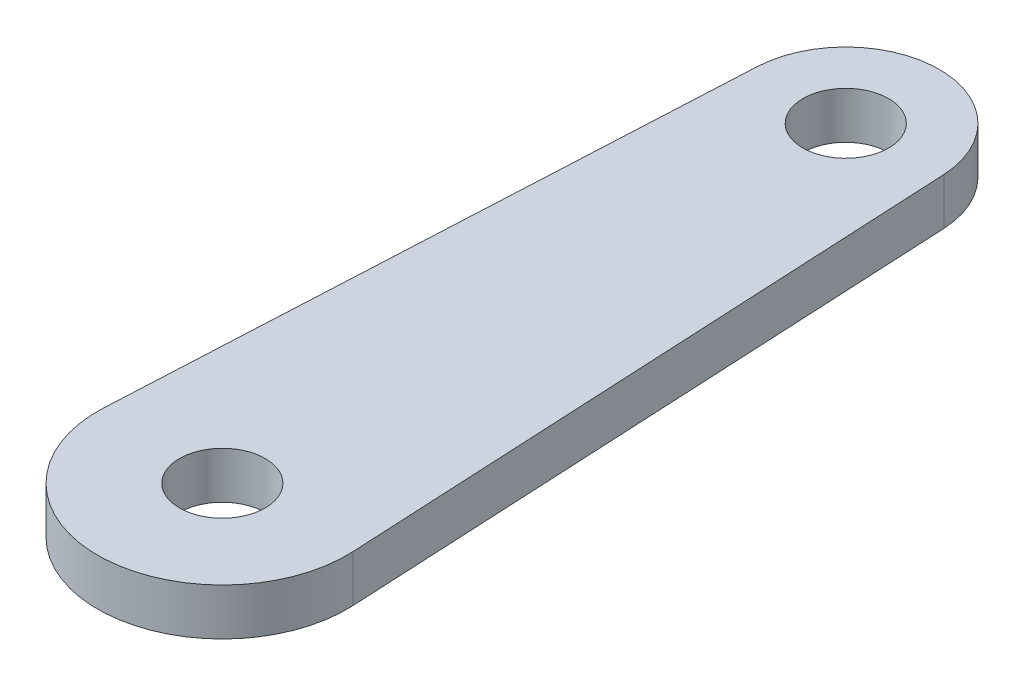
ISO-10303-21;
HEADER;
FILE_DESCRIPTION(('STEP AP214'),'2;1');
FILE_NAME('part.step','',(''),(''),'','','');
FILE_SCHEMA(('AUTOMOTIVE_DESIGN { 1 0 10303 214 1 1 1 1 }'));
ENDSEC;
DATA;
#1=APPLICATION_CONTEXT('core data for automotive mechanical design processes');
#2=APPLICATION_PROTOCOL_DEFINITION('international standard','automotive_design',2000,#1);
#3=PRODUCT_CONTEXT('',#1,'mechanical');
#4=PRODUCT('Part','Part','',(#3));
#5=PRODUCT_RELATED_PRODUCT_CATEGORY('part','',(#4));
#6=PRODUCT_DEFINITION_FORMATION('','',#4);
#7=PRODUCT_DEFINITION_CONTEXT('part definition',#1,'design');
#8=PRODUCT_DEFINITION('design','',#6,#7);
#9=PRODUCT_DEFINITION_SHAPE('','',#8);
#10=(LENGTH_UNIT() NAMED_UNIT(*) SI_UNIT(.MILLI.,.METRE.));
#11=(NAMED_UNIT(*) PLANE_ANGLE_UNIT() SI_UNIT($,.RADIAN.));
#12=(NAMED_UNIT(*) SI_UNIT($,.STERADIAN.) SOLID_ANGLE_UNIT());
#13=UNCERTAINTY_MEASURE_WITH_UNIT(LENGTH_MEASURE(1.E-05),#10,'distance_accuracy_value','');
#14=(GEOMETRIC_REPRESENTATION_CONTEXT(3) GLOBAL_UNCERTAINTY_ASSIGNED_CONTEXT((#13)) GLOBAL_UNIT_ASSIGNED_CONTEXT((#10,
#11,#12)) REPRESENTATION_CONTEXT('',''));
#15=CARTESIAN_POINT('',(0.,0.,0.));
#16=DIRECTION('',(0.,0.,1.));
#17=DIRECTION('',(1.,0.,0.));
#18=AXIS2_PLACEMENT_3D('',#15,#16,#17);
#19=CARTESIAN_POINT('',(0.,3.,-40.));
#20=DIRECTION('',(0.,1.,0.));
#21=DIRECTION('',(0.,0.,1.));
#22=AXIS2_PLACEMENT_3D('',#19,#20,#21);
#23=PLANE('',#22);
#24=CARTESIAN_POINT('',(0.,3.,0.));
#25=DIRECTION('',(0.,1.,0.));
#26=DIRECTION('',(0.,0.,1.));
#27=AXIS2_PLACEMENT_3D('',#24,#25,#26);
#28=CIRCLE('',#27,2.75);
#29=CARTESIAN_POINT('',(0.,3.,2.75));
#30=VERTEX_POINT('',#29);
#31=EDGE_CURVE('E95',#30,#30,#28,.T.);
#32=ORIENTED_EDGE('',*,*,#31,.F.);
#33=EDGE_LOOP('',(#32));
#34=FACE_BOUND('',#33,.T.);
#35=CARTESIAN_POINT('',(0.,3.,-40.));
#36=DIRECTION('',(0.,1.,0.));
#37=DIRECTION('',(0.,0.,1.));
#38=AXIS2_PLACEMENT_3D('',#35,#36,#37);
#39=CIRCLE('',#38,6.);
#40=CARTESIAN_POINT('',(5.99249530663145,3.,-40.3));
#41=VERTEX_POINT('',#40);
#42=CARTESIAN_POINT('',(-5.99249530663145,3.,-40.3));
#43=VERTEX_POINT('',#42);
#44=EDGE_CURVE('E80',#41,#43,#39,.T.);
#45=ORIENTED_EDGE('',*,*,#44,.T.);
#46=DIRECTION('',(-0.05,0.,0.998749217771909));
#47=VECTOR('',#46,1.);
#48=CARTESIAN_POINT('',(-5.99249530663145,3.,-40.3));
#49=LINE('',#48,#47);
#50=CARTESIAN_POINT('',(-7.98999374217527,3.,-0.4));
#51=VERTEX_POINT('',#50);
#52=EDGE_CURVE('E75',#43,#51,#49,.T.);
#53=ORIENTED_EDGE('',*,*,#52,.T.);
#54=CARTESIAN_POINT('',(0.,3.,0.));
#55=DIRECTION('',(0.,1.,0.));
#56=DIRECTION('',(0.,0.,1.));
#57=AXIS2_PLACEMENT_3D('',#54,#55,#56);
#58=CIRCLE('',#57,8.);
#59=CARTESIAN_POINT('',(7.98999374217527,3.,-0.400000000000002));
#60=VERTEX_POINT('',#59);
#61=EDGE_CURVE('E78',#51,#60,#58,.T.);
#62=ORIENTED_EDGE('',*,*,#61,.T.);
#63=DIRECTION('',(-0.05,0.,-0.998749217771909));
#64=VECTOR('',#63,1.);
#65=CARTESIAN_POINT('',(5.99249530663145,3.,-40.3));
#66=LINE('',#65,#64);
#67=EDGE_CURVE('E45',#60,#41,#66,.T.);
#68=ORIENTED_EDGE('',*,*,#67,.T.);
#69=EDGE_LOOP('',(#45,#53,#62,#68));
#70=FACE_BOUND('',#69,.T.);
#71=CARTESIAN_POINT('',(0.,3.,-40.));
#72=DIRECTION('',(0.,1.,0.));
#73=DIRECTION('',(0.,0.,1.));
#74=AXIS2_PLACEMENT_3D('',#71,#72,#73);
#75=CIRCLE('',#74,2.75);
#76=CARTESIAN_POINT('',(0.,3.,-37.25));
#77=VERTEX_POINT('',#76);
#78=EDGE_CURVE('E110',#77,#77,#75,.T.);
#79=ORIENTED_EDGE('',*,*,#78,.F.);
#80=EDGE_LOOP('',(#79));
#81=FACE_BOUND('',#80,.T.);
#82=ADVANCED_FACE('F28',(#34,#70,#81),#23,.T.);
#83=CARTESIAN_POINT('',(0.,0.,-40.));
#84=DIRECTION('',(0.,1.,0.));
#85=DIRECTION('',(0.,0.,1.));
#86=AXIS2_PLACEMENT_3D('',#83,#84,#85);
#87=PLANE('',#86);
#88=CARTESIAN_POINT('',(0.,0.,0.));
#89=DIRECTION('',(0.,1.,0.));
#90=DIRECTION('',(0.,0.,1.));
#91=AXIS2_PLACEMENT_3D('',#88,#89,#90);
#92=CIRCLE('',#91,2.75);
#93=CARTESIAN_POINT('',(0.,0.,2.75));
#94=VERTEX_POINT('',#93);
#95=EDGE_CURVE('E107',#94,#94,#92,.T.);
#96=ORIENTED_EDGE('',*,*,#95,.T.);
#97=EDGE_LOOP('',(#96));
#98=FACE_BOUND('',#97,.T.);
#99=CARTESIAN_POINT('',(0.,0.,-40.));
#100=DIRECTION('',(0.,1.,0.));
#101=DIRECTION('',(0.,0.,1.));
#102=AXIS2_PLACEMENT_3D('',#99,#100,#101);
#103=CIRCLE('',#102,6.);
#104=CARTESIAN_POINT('',(5.99249530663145,0.,-40.3));
#105=VERTEX_POINT('',#104);
#106=CARTESIAN_POINT('',(-5.99249530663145,0.,-40.3));
#107=VERTEX_POINT('',#106);
#108=EDGE_CURVE('E92',#105,#107,#103,.T.);
#109=ORIENTED_EDGE('',*,*,#108,.F.);
#110=DIRECTION('',(-0.05,0.,-0.998749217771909));
#111=VECTOR('',#110,1.);
#112=CARTESIAN_POINT('',(5.99249530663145,0.,-40.3));
#113=LINE('',#112,#111);
#114=CARTESIAN_POINT('',(7.98999374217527,0.,-0.400000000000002));
#115=VERTEX_POINT('',#114);
#116=EDGE_CURVE('E68',#115,#105,#113,.T.);
#117=ORIENTED_EDGE('',*,*,#116,.F.);
#118=CARTESIAN_POINT('',(0.,0.,0.));
#119=DIRECTION('',(0.,1.,0.));
#120=DIRECTION('',(0.,0.,1.));
#121=AXIS2_PLACEMENT_3D('',#118,#119,#120);
#122=CIRCLE('',#121,8.);
#123=CARTESIAN_POINT('',(-7.98999374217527,0.,-0.4));
#124=VERTEX_POINT('',#123);
#125=EDGE_CURVE('E62',#124,#115,#122,.T.);
#126=ORIENTED_EDGE('',*,*,#125,.F.);
#127=DIRECTION('',(-0.05,0.,0.998749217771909));
#128=VECTOR('',#127,1.);
#129=CARTESIAN_POINT('',(-5.99249530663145,0.,-40.3));
#130=LINE('',#129,#128);
#131=EDGE_CURVE('E84',#107,#124,#130,.T.);
#132=ORIENTED_EDGE('',*,*,#131,.F.);
#133=EDGE_LOOP('',(#109,#117,#126,#132));
#134=FACE_BOUND('',#133,.T.);
#135=CARTESIAN_POINT('',(0.,0.,-40.));
#136=DIRECTION('',(0.,1.,0.));
#137=DIRECTION('',(0.,0.,1.));
#138=AXIS2_PLACEMENT_3D('',#135,#136,#137);
#139=CIRCLE('',#138,2.75);
#140=CARTESIAN_POINT('',(0.,0.,-37.25));
#141=VERTEX_POINT('',#140);
#142=EDGE_CURVE('E113',#141,#141,#139,.T.);
#143=ORIENTED_EDGE('',*,*,#142,.T.);
#144=EDGE_LOOP('',(#143));
#145=FACE_BOUND('',#144,.T.);
#146=ADVANCED_FACE('F103',(#98,#134,#145),#87,.F.);
#147=CARTESIAN_POINT('',(0.,3.,-40.));
#148=DIRECTION('',(0.,-1.,0.));
#149=DIRECTION('',(0.,0.,-1.));
#150=AXIS2_PLACEMENT_3D('',#147,#148,#149);
#151=CYLINDRICAL_SURFACE('',#150,6.);
#152=ORIENTED_EDGE('',*,*,#108,.T.);
#153=DIRECTION('',(0.,-1.,0.));
#154=VECTOR('',#153,1.);
#155=CARTESIAN_POINT('',(-5.99249530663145,3.,-40.3));
#156=LINE('',#155,#154);
#157=EDGE_CURVE('E11',#43,#107,#156,.T.);
#158=ORIENTED_EDGE('',*,*,#157,.F.);
#159=ORIENTED_EDGE('',*,*,#44,.F.);
#160=DIRECTION('',(0.,-1.,0.));
#161=VECTOR('',#160,1.);
#162=CARTESIAN_POINT('',(5.99249530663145,3.,-40.3));
#163=LINE('',#162,#161);
#164=EDGE_CURVE('E88',#41,#105,#163,.T.);
#165=ORIENTED_EDGE('',*,*,#164,.T.);
#166=EDGE_LOOP('',(#152,#158,#159,#165));
#167=FACE_BOUND('',#166,.T.);
#168=ADVANCED_FACE('F30',(#167),#151,.T.);
#169=CARTESIAN_POINT('',(-5.99249530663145,3.,-40.3));
#170=DIRECTION('',(0.998749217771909,0.,0.05));
#171=DIRECTION('',(0.05,0.,-0.998749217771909));
#172=AXIS2_PLACEMENT_3D('',#169,#170,#171);
#173=PLANE('',#172);
#174=ORIENTED_EDGE('',*,*,#131,.T.);
#175=DIRECTION('',(0.,-1.,0.));
#176=VECTOR('',#175,1.);
#177=CARTESIAN_POINT('',(-7.98999374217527,3.,-0.4));
#178=LINE('',#177,#176);
#179=EDGE_CURVE('E37',#51,#124,#178,.T.);
#180=ORIENTED_EDGE('',*,*,#179,.F.);
#181=ORIENTED_EDGE('',*,*,#52,.F.);
#182=ORIENTED_EDGE('',*,*,#157,.T.);
#183=EDGE_LOOP('',(#174,#180,#181,#182));
#184=FACE_BOUND('',#183,.T.);
#185=ADVANCED_FACE('F83',(#184),#173,.F.);
#186=CARTESIAN_POINT('',(0.,3.,0.));
#187=DIRECTION('',(0.,-1.,0.));
#188=DIRECTION('',(0.,0.,-1.));
#189=AXIS2_PLACEMENT_3D('',#186,#187,#188);
#190=CYLINDRICAL_SURFACE('',#189,8.);
#191=ORIENTED_EDGE('',*,*,#125,.T.);
#192=DIRECTION('',(0.,-1.,0.));
#193=VECTOR('',#192,1.);
#194=CARTESIAN_POINT('',(7.98999374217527,3.,-0.400000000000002));
#195=LINE('',#194,#193);
#196=EDGE_CURVE('E85',#60,#115,#195,.T.);
#197=ORIENTED_EDGE('',*,*,#196,.F.);
#198=ORIENTED_EDGE('',*,*,#61,.F.);
#199=ORIENTED_EDGE('',*,*,#179,.T.);
#200=EDGE_LOOP('',(#191,#197,#198,#199));
#201=FACE_BOUND('',#200,.T.);
#202=ADVANCED_FACE('F86',(#201),#190,.T.);
#203=CARTESIAN_POINT('',(5.99249530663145,3.,-40.3));
#204=DIRECTION('',(-0.998749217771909,0.,0.05));
#205=DIRECTION('',(0.05,0.,0.998749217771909));
#206=AXIS2_PLACEMENT_3D('',#203,#204,#205);
#207=PLANE('',#206);
#208=ORIENTED_EDGE('',*,*,#116,.T.);
#209=ORIENTED_EDGE('',*,*,#164,.F.);
#210=ORIENTED_EDGE('',*,*,#67,.F.);
#211=ORIENTED_EDGE('',*,*,#196,.T.);
#212=EDGE_LOOP('',(#208,#209,#210,#211));
#213=FACE_BOUND('',#212,.T.);
#214=ADVANCED_FACE('F100',(#213),#207,.F.);
#215=CARTESIAN_POINT('',(0.,3.,0.));
#216=DIRECTION('',(0.,-1.,0.));
#217=DIRECTION('',(0.,0.,-1.));
#218=AXIS2_PLACEMENT_3D('',#215,#216,#217);
#219=CYLINDRICAL_SURFACE('',#218,2.75);
#220=ORIENTED_EDGE('',*,*,#31,.T.);
#221=EDGE_LOOP('',(#220));
#222=FACE_BOUND('',#221,.T.);
#223=ORIENTED_EDGE('',*,*,#95,.F.);
#224=EDGE_LOOP('',(#223));
#225=FACE_BOUND('',#224,.T.);
#226=ADVANCED_FACE('F131',(#222,#225),#219,.F.);
#227=CARTESIAN_POINT('',(0.,3.,-40.));
#228=DIRECTION('',(0.,-1.,0.));
#229=DIRECTION('',(0.,0.,-1.));
#230=AXIS2_PLACEMENT_3D('',#227,#228,#229);
#231=CYLINDRICAL_SURFACE('',#230,2.75);
#232=ORIENTED_EDGE('',*,*,#78,.T.);
#233=EDGE_LOOP('',(#232));
#234=FACE_BOUND('',#233,.T.);
#235=ORIENTED_EDGE('',*,*,#142,.F.);
#236=EDGE_LOOP('',(#235));
#237=FACE_BOUND('',#236,.T.);
#238=ADVANCED_FACE('F119',(#234,#237),#231,.F.);
#239=CLOSED_SHELL('',(#82,#146,#168,#185,#202,#214,#226,#238));
#240=MANIFOLD_SOLID_BREP('B2',#239);
#241=ADVANCED_BREP_SHAPE_REPRESENTATION('',(#18,#240),#14);
#242=SHAPE_DEFINITION_REPRESENTATION(#9,#241);
ENDSEC;
END-ISO-10303-21;
